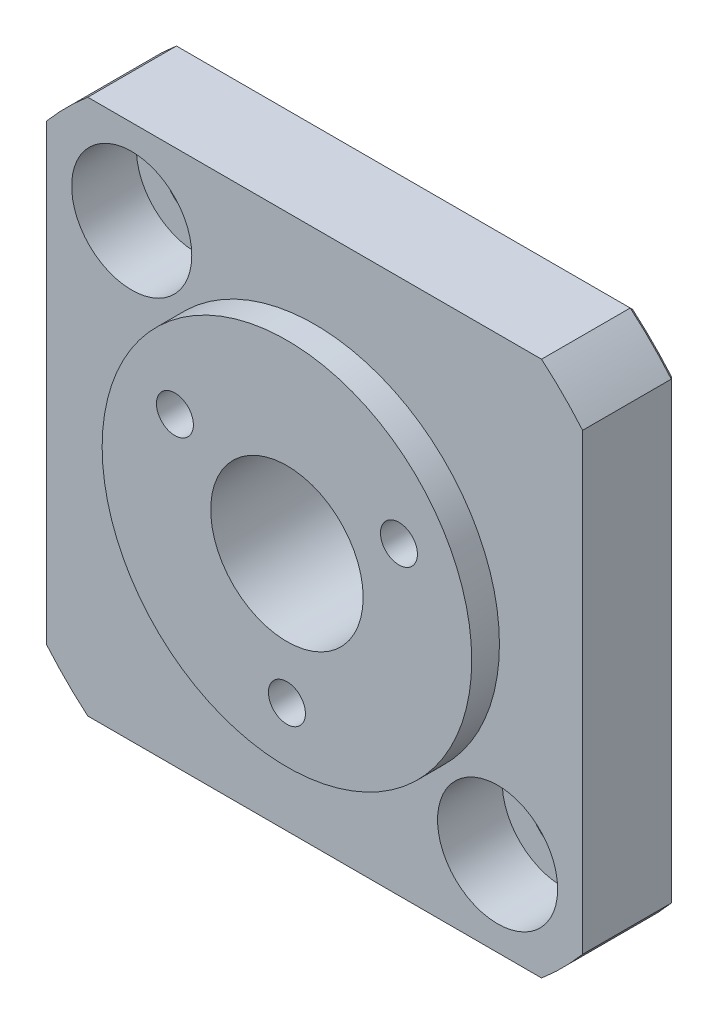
from build123d import *

# Parameters (mm, degrees)
BASE_EXTRUDE_DEPTH                 = 5
SKETCH2_R                          = 1.75
THRU_HOLES_DEPTH                   = 22.106870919
SKETCH3_R                          = 10
NOSE_DEPTH                         = 1.5
SKETCH4_R                          = 4.125
BORE_DEPTH                         = 22.511624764
CHAMFER1_SIZE                      = 0.2
SKETCH5_R                          = 3.25
CBORE_DEPTH                        = 3.5
M2_0_2_000000_DIAMETER_HOLE1_D     = 2
M2_0_2_000000_DIAMETER_HOLE1_DEPTH = 1.5
CIRPATTERN1_COUNT                  = 3


with BuildPart() as part:
    # Sketch1 → Base-Extrude (new body)
    with BuildSketch(Plane.XY):
        with BuildLine():
            Line((-12.278029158, 14.5), (12.278029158, 14.5))
            ThreePointArc((12.278029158, 14.5), (13.435028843, 13.435028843), (14.5, 12.278029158))
            Line((14.5, 12.278029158), (14.5, -12.278029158))
            ThreePointArc((14.5, -12.278029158), (13.435028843, -13.435028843), (12.278029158, -14.5))
            Line((12.278029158, -14.5), (-12.278029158, -14.5))
            ThreePointArc((-12.278029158, -14.5), (-13.435028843, -13.435028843), (-14.5, -12.278029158))
            Line((-14.5, -12.278029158), (-14.5, 12.278029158))
            ThreePointArc((-14.5, 12.278029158), (-13.435028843, 13.435028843), (-12.278029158, 14.5))
        make_face()
    extrude(amount=BASE_EXTRUDE_DEPTH)

    # Sketch2 → Thru Holes (cut, through all)
    with BuildSketch(Plane.XY.offset(5)):
        with Locations((-9.9, 9.9)):
            Circle(SKETCH2_R)
        with Locations((9.9, -9.9)):
            Circle(SKETCH2_R)
    extrude(amount=-THRU_HOLES_DEPTH, mode=Mode.SUBTRACT)

    # Sketch3 → Nose (add)
    with BuildSketch(Plane.XY.offset(5)):
        Circle(SKETCH3_R)
    extrude(amount=NOSE_DEPTH)

    # Sketch4 → Bore (cut, through all)
    with BuildSketch(Plane.XY.offset(6.5)):
        Circle(SKETCH4_R)
    extrude(amount=-BORE_DEPTH, mode=Mode.SUBTRACT)

    # Chamfer1
    chamfer1_edges = [part.edges().sort_by_distance(p)[0] for p in [
        (14.5, 0, 0),
        (13.435028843, -13.435028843, 0),
        (0, -14.5, 0),
        (-13.435028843, -13.435028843, 0),
        (-14.5, 0, 0),
        (-13.435028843, 13.435028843, 0),
        (0, 14.5, 0),
        (13.435028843, 13.435028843, 0),
    ]]
    chamfer(chamfer1_edges, length=CHAMFER1_SIZE)

    # Sketch5 → Cbore (cut)
    with BuildSketch(Plane.XY.offset(5)):
        with Locations((-9.9, 9.9)):
            Circle(SKETCH5_R)
        with Locations((9.9, -9.9)):
            Circle(SKETCH5_R)
    extrude(amount=-CBORE_DEPTH, mode=Mode.SUBTRACT)

    # M2.0 _2.000000_ Diameter Hole1
    with Locations(Plane.XY.offset(6.5)):
        with Locations((6.062177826, 3.5)):
            m2_0_2_000000_diameter_hole1 = Hole(M2_0_2_000000_DIAMETER_HOLE1_D / 2, depth=M2_0_2_000000_DIAMETER_HOLE1_DEPTH)

    # CirPattern1: M2.0 _2.000000_ Diameter Hole1 ×3 about axis
    cirpattern1_axis = Axis((0, 0, 0), (0, 0, 1))
    for i in range(1, CIRPATTERN1_COUNT):
        add(m2_0_2_000000_diameter_hole1.rotate(cirpattern1_axis, i * 360 / CIRPATTERN1_COUNT), mode=Mode.SUBTRACT)


solid = part.part
